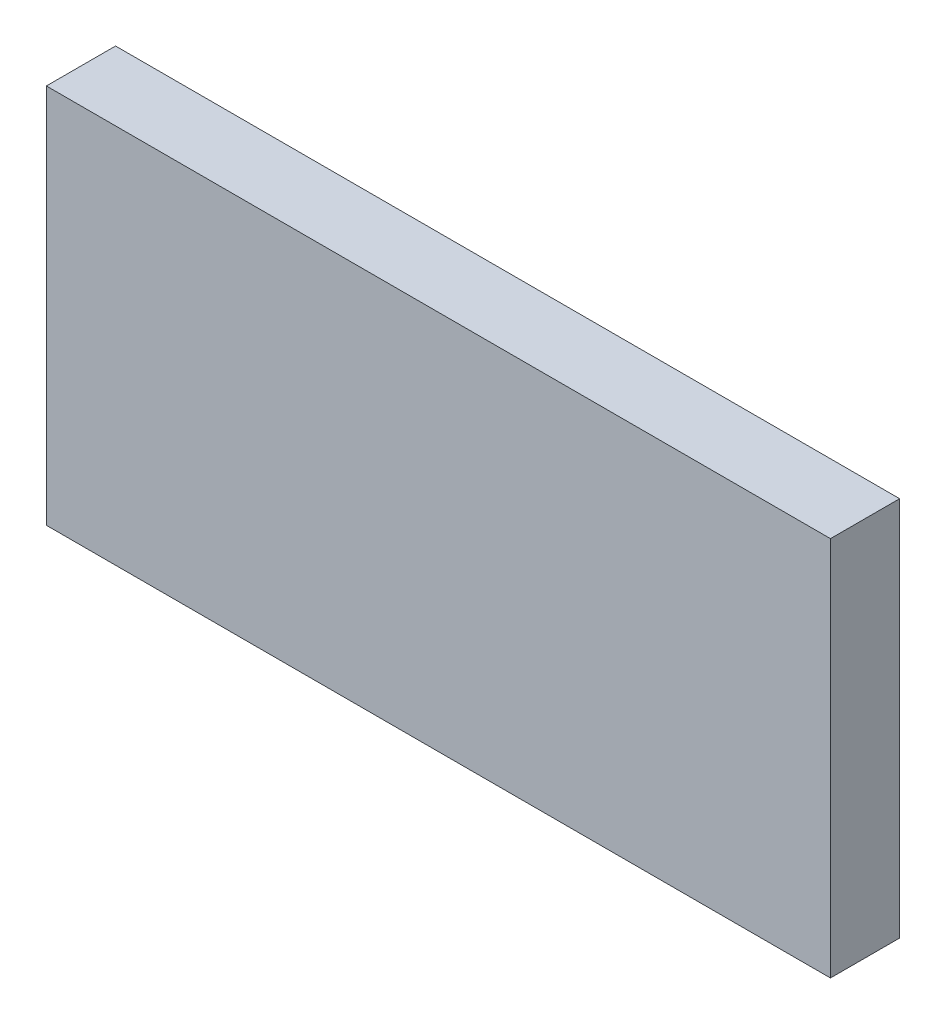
from build123d import *

# Parameters (mm, degrees)
ESQUISSE1_W      = 68
ESQUISSE1_H      = 33
EXTRUSION1_DEPTH = 6


with BuildPart() as part:
    # Esquisse1 → Extrusion1 (new body)
    with BuildSketch(Plane.XY):
        with Locations((34, 16.5)):
            Rectangle(ESQUISSE1_W, ESQUISSE1_H)
    extrude(amount=EXTRUSION1_DEPTH)


solid = part.part
